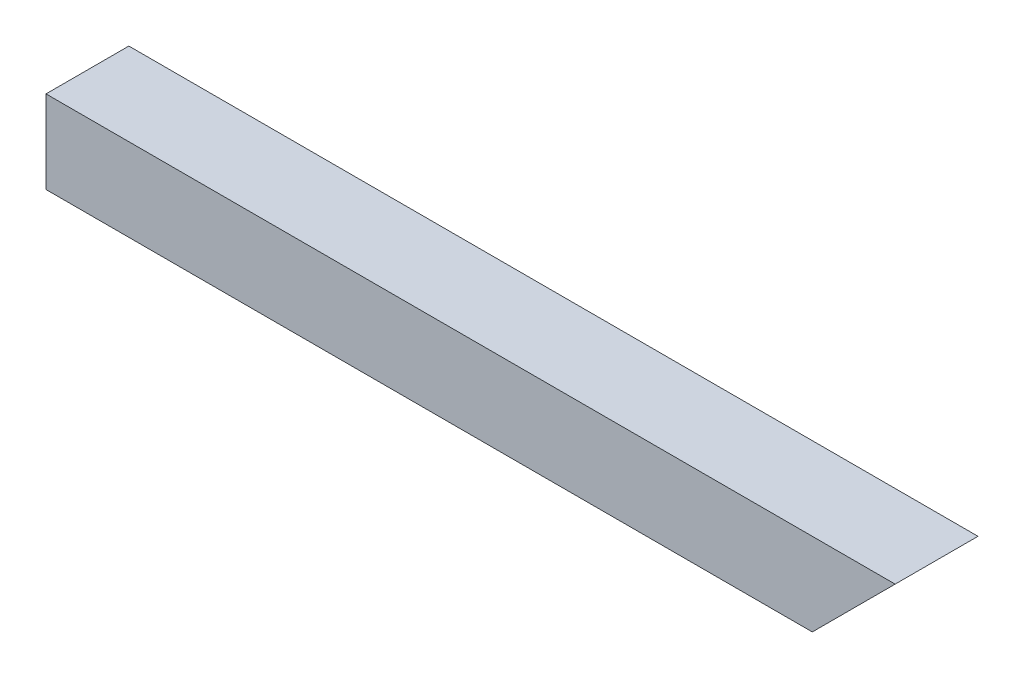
from build123d import *

# Parameters (mm, degrees)
BOSS_EXTRU_1_DEPTH = 40


with BuildPart() as part:
    # Esquisse1 → Boss.-Extru.1 (new body)
    with BuildSketch(Plane.XY):
        Polygon((0, 410), (410, 410), (370, 370), (0, 370), align=None)
    extrude(amount=-BOSS_EXTRU_1_DEPTH)


solid = part.part
